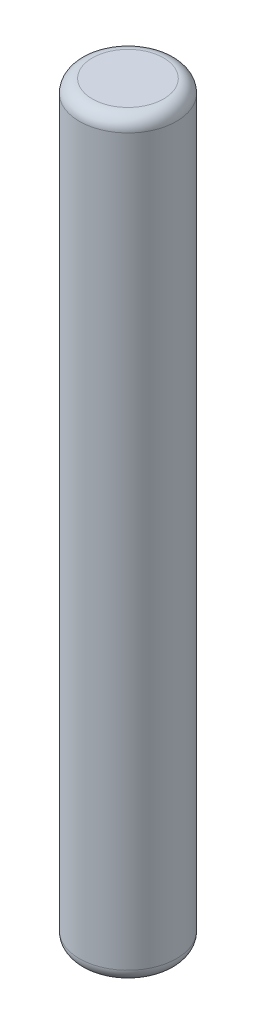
ISO-10303-21;
HEADER;
FILE_DESCRIPTION(('STEP AP214'),'2;1');
FILE_NAME('part.step','',(''),(''),'','','');
FILE_SCHEMA(('AUTOMOTIVE_DESIGN { 1 0 10303 214 1 1 1 1 }'));
ENDSEC;
DATA;
#1=APPLICATION_CONTEXT('core data for automotive mechanical design processes');
#2=APPLICATION_PROTOCOL_DEFINITION('international standard','automotive_design',2000,#1);
#3=PRODUCT_CONTEXT('',#1,'mechanical');
#4=PRODUCT('Part','Part','',(#3));
#5=PRODUCT_RELATED_PRODUCT_CATEGORY('part','',(#4));
#6=PRODUCT_DEFINITION_FORMATION('','',#4);
#7=PRODUCT_DEFINITION_CONTEXT('part definition',#1,'design');
#8=PRODUCT_DEFINITION('design','',#6,#7);
#9=PRODUCT_DEFINITION_SHAPE('','',#8);
#10=(LENGTH_UNIT() NAMED_UNIT(*) SI_UNIT(.MILLI.,.METRE.));
#11=(NAMED_UNIT(*) PLANE_ANGLE_UNIT() SI_UNIT($,.RADIAN.));
#12=(NAMED_UNIT(*) SI_UNIT($,.STERADIAN.) SOLID_ANGLE_UNIT());
#13=UNCERTAINTY_MEASURE_WITH_UNIT(LENGTH_MEASURE(1.E-05),#10,'distance_accuracy_value','');
#14=(GEOMETRIC_REPRESENTATION_CONTEXT(3) GLOBAL_UNCERTAINTY_ASSIGNED_CONTEXT((#13)) GLOBAL_UNIT_ASSIGNED_CONTEXT((#10,
#11,#12)) REPRESENTATION_CONTEXT('',''));
#15=CARTESIAN_POINT('',(0.,0.,0.));
#16=DIRECTION('',(0.,0.,1.));
#17=DIRECTION('',(1.,0.,0.));
#18=AXIS2_PLACEMENT_3D('',#15,#16,#17);
#19=CARTESIAN_POINT('',(0.,5.8,0.));
#20=DIRECTION('',(0.,-1.,0.));
#21=DIRECTION('',(0.,0.,-1.));
#22=AXIS2_PLACEMENT_3D('',#19,#20,#21);
#23=CYLINDRICAL_SURFACE('',#22,0.375);
#24=CARTESIAN_POINT('',(0.,0.1,0.));
#25=DIRECTION('',(0.,1.,0.));
#26=DIRECTION('',(0.,0.,1.));
#27=AXIS2_PLACEMENT_3D('',#24,#25,#26);
#28=CIRCLE('',#27,0.375);
#29=CARTESIAN_POINT('',(0.,0.1,0.375));
#30=VERTEX_POINT('',#29);
#31=EDGE_CURVE('E43',#30,#30,#28,.T.);
#32=ORIENTED_EDGE('',*,*,#31,.T.);
#33=EDGE_LOOP('',(#32));
#34=FACE_BOUND('',#33,.T.);
#35=CARTESIAN_POINT('',(0.,5.7,0.));
#36=DIRECTION('',(0.,1.,0.));
#37=DIRECTION('',(0.,0.,1.));
#38=AXIS2_PLACEMENT_3D('',#35,#36,#37);
#39=CIRCLE('',#38,0.375);
#40=CARTESIAN_POINT('',(0.,5.7,0.375));
#41=VERTEX_POINT('',#40);
#42=EDGE_CURVE('E47',#41,#41,#39,.F.);
#43=ORIENTED_EDGE('',*,*,#42,.T.);
#44=EDGE_LOOP('',(#43));
#45=FACE_BOUND('',#44,.T.);
#46=ADVANCED_FACE('F32',(#34,#45),#23,.T.);
#47=CARTESIAN_POINT('',(0.,5.8,0.));
#48=DIRECTION('',(0.,1.,0.));
#49=DIRECTION('',(0.,0.,1.));
#50=AXIS2_PLACEMENT_3D('',#47,#48,#49);
#51=PLANE('',#50);
#52=CARTESIAN_POINT('',(0.,5.8,0.));
#53=DIRECTION('',(0.,1.,0.));
#54=DIRECTION('',(0.,0.,1.));
#55=AXIS2_PLACEMENT_3D('',#52,#53,#54);
#56=CIRCLE('',#55,0.275);
#57=CARTESIAN_POINT('',(0.,5.8,0.275));
#58=VERTEX_POINT('',#57);
#59=EDGE_CURVE('E10',#58,#58,#56,.T.);
#60=ORIENTED_EDGE('',*,*,#59,.T.);
#61=EDGE_LOOP('',(#60));
#62=FACE_BOUND('',#61,.T.);
#63=ADVANCED_FACE('F63',(#62),#51,.T.);
#64=CARTESIAN_POINT('',(0.,0.,0.));
#65=DIRECTION('',(0.,1.,0.));
#66=DIRECTION('',(0.,0.,1.));
#67=AXIS2_PLACEMENT_3D('',#64,#65,#66);
#68=PLANE('',#67);
#69=CARTESIAN_POINT('',(0.,0.,0.));
#70=DIRECTION('',(0.,1.,0.));
#71=DIRECTION('',(0.,0.,1.));
#72=AXIS2_PLACEMENT_3D('',#69,#70,#71);
#73=CIRCLE('',#72,0.275);
#74=CARTESIAN_POINT('',(0.,0.,0.275));
#75=VERTEX_POINT('',#74);
#76=EDGE_CURVE('E39',#75,#75,#73,.F.);
#77=ORIENTED_EDGE('',*,*,#76,.T.);
#78=EDGE_LOOP('',(#77));
#79=FACE_BOUND('',#78,.T.);
#80=ADVANCED_FACE('F60',(#79),#68,.F.);
#81=CARTESIAN_POINT('',(0.,0.1,0.));
#82=DIRECTION('',(0.,1.,0.));
#83=DIRECTION('',(0.,0.,1.));
#84=AXIS2_PLACEMENT_3D('',#81,#82,#83);
#85=TOROIDAL_SURFACE('',#84,0.275,0.1);
#86=ORIENTED_EDGE('',*,*,#76,.F.);
#87=EDGE_LOOP('',(#86));
#88=FACE_BOUND('',#87,.T.);
#89=ORIENTED_EDGE('',*,*,#31,.F.);
#90=EDGE_LOOP('',(#89));
#91=FACE_BOUND('',#90,.T.);
#92=ADVANCED_FACE('F56',(#88,#91),#85,.T.);
#93=CARTESIAN_POINT('',(0.,5.7,0.));
#94=DIRECTION('',(0.,1.,0.));
#95=DIRECTION('',(0.,0.,1.));
#96=AXIS2_PLACEMENT_3D('',#93,#94,#95);
#97=TOROIDAL_SURFACE('',#96,0.275,0.1);
#98=ORIENTED_EDGE('',*,*,#42,.F.);
#99=EDGE_LOOP('',(#98));
#100=FACE_BOUND('',#99,.T.);
#101=ORIENTED_EDGE('',*,*,#59,.F.);
#102=EDGE_LOOP('',(#101));
#103=FACE_BOUND('',#102,.T.);
#104=ADVANCED_FACE('F34',(#100,#103),#97,.T.);
#105=CLOSED_SHELL('',(#46,#63,#80,#92,#104));
#106=MANIFOLD_SOLID_BREP('B2',#105);
#107=ADVANCED_BREP_SHAPE_REPRESENTATION('',(#18,#106),#14);
#108=SHAPE_DEFINITION_REPRESENTATION(#9,#107);
ENDSEC;
END-ISO-10303-21;
